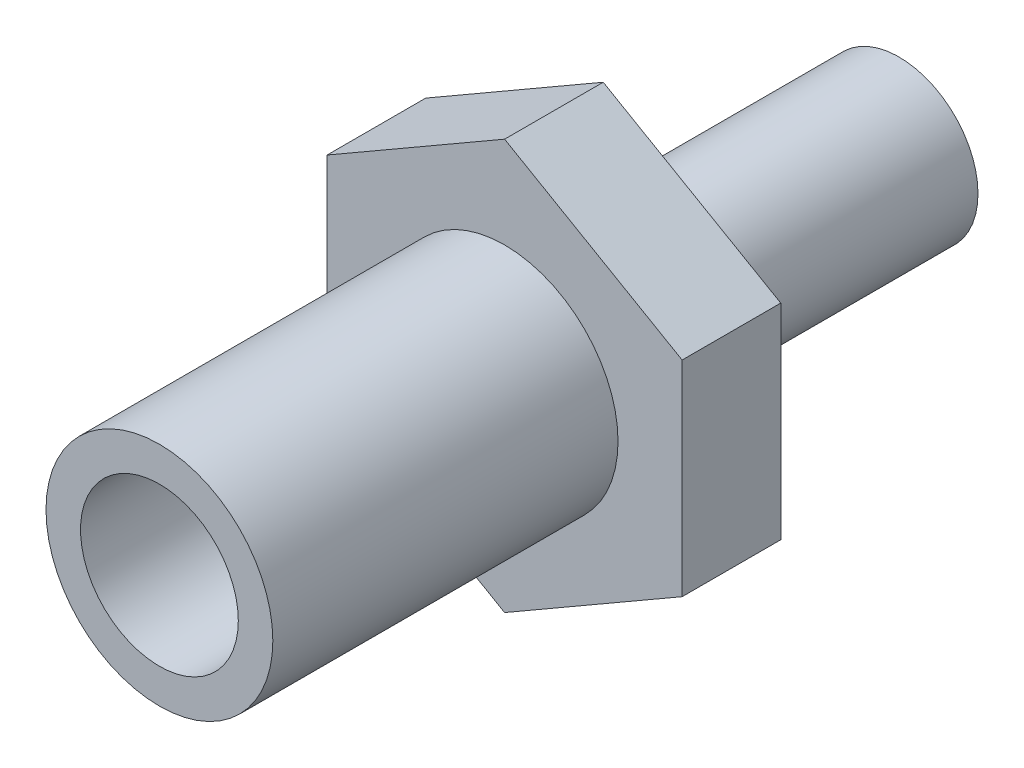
ISO-10303-21;
HEADER;
FILE_DESCRIPTION(('STEP AP214'),'2;1');
FILE_NAME('part.step','',(''),(''),'','','');
FILE_SCHEMA(('AUTOMOTIVE_DESIGN { 1 0 10303 214 1 1 1 1 }'));
ENDSEC;
DATA;
#1=APPLICATION_CONTEXT('core data for automotive mechanical design processes');
#2=APPLICATION_PROTOCOL_DEFINITION('international standard','automotive_design',2000,#1);
#3=PRODUCT_CONTEXT('',#1,'mechanical');
#4=PRODUCT('Part','Part','',(#3));
#5=PRODUCT_RELATED_PRODUCT_CATEGORY('part','',(#4));
#6=PRODUCT_DEFINITION_FORMATION('','',#4);
#7=PRODUCT_DEFINITION_CONTEXT('part definition',#1,'design');
#8=PRODUCT_DEFINITION('design','',#6,#7);
#9=PRODUCT_DEFINITION_SHAPE('','',#8);
#10=(LENGTH_UNIT() NAMED_UNIT(*) SI_UNIT(.MILLI.,.METRE.));
#11=(NAMED_UNIT(*) PLANE_ANGLE_UNIT() SI_UNIT($,.RADIAN.));
#12=(NAMED_UNIT(*) SI_UNIT($,.STERADIAN.) SOLID_ANGLE_UNIT());
#13=UNCERTAINTY_MEASURE_WITH_UNIT(LENGTH_MEASURE(1.E-05),#10,'distance_accuracy_value','');
#14=(GEOMETRIC_REPRESENTATION_CONTEXT(3) GLOBAL_UNCERTAINTY_ASSIGNED_CONTEXT((#13)) GLOBAL_UNIT_ASSIGNED_CONTEXT((#10,
#11,#12)) REPRESENTATION_CONTEXT('',''));
#15=CARTESIAN_POINT('',(0.,0.,0.));
#16=DIRECTION('',(0.,0.,1.));
#17=DIRECTION('',(1.,0.,0.));
#18=AXIS2_PLACEMENT_3D('',#15,#16,#17);
#19=CARTESIAN_POINT('',(22.,0.,10.));
#20=DIRECTION('',(0.,0.,-1.));
#21=DIRECTION('',(-1.,0.,0.));
#22=AXIS2_PLACEMENT_3D('',#19,#20,#21);
#23=PLANE('',#22);
#24=DIRECTION('',(-0.866025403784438,0.5,0.));
#25=VECTOR('',#24,1.);
#26=CARTESIAN_POINT('',(0.,-20.7846096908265,10.));
#27=LINE('',#26,#25);
#28=CARTESIAN_POINT('',(0.,-20.7846096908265,10.));
#29=VERTEX_POINT('',#28);
#30=CARTESIAN_POINT('',(-18.,-10.3923048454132,10.));
#31=VERTEX_POINT('',#30);
#32=EDGE_CURVE('E95',#29,#31,#27,.T.);
#33=ORIENTED_EDGE('',*,*,#32,.F.);
#34=DIRECTION('',(0.866025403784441,0.5,0.));
#35=VECTOR('',#34,1.);
#36=CARTESIAN_POINT('',(0.,-20.7846096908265,10.));
#37=LINE('',#36,#35);
#38=CARTESIAN_POINT('',(18.,-10.3923048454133,10.));
#39=VERTEX_POINT('',#38);
#40=EDGE_CURVE('E37',#29,#39,#37,.T.);
#41=ORIENTED_EDGE('',*,*,#40,.T.);
#42=DIRECTION('',(0.,-1.,0.));
#43=VECTOR('',#42,1.);
#44=CARTESIAN_POINT('',(18.,10.3923048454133,10.));
#45=LINE('',#44,#43);
#46=CARTESIAN_POINT('',(18.,10.3923048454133,10.));
#47=VERTEX_POINT('',#46);
#48=EDGE_CURVE('E74',#47,#39,#45,.T.);
#49=ORIENTED_EDGE('',*,*,#48,.F.);
#50=DIRECTION('',(0.866025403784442,-0.5,0.));
#51=VECTOR('',#50,1.);
#52=CARTESIAN_POINT('',(0.,20.7846096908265,10.));
#53=LINE('',#52,#51);
#54=CARTESIAN_POINT('',(0.,20.7846096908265,10.));
#55=VERTEX_POINT('',#54);
#56=EDGE_CURVE('E104',#55,#47,#53,.T.);
#57=ORIENTED_EDGE('',*,*,#56,.F.);
#58=DIRECTION('',(-0.866025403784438,-0.5,0.));
#59=VECTOR('',#58,1.);
#60=CARTESIAN_POINT('',(0.,20.7846096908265,10.));
#61=LINE('',#60,#59);
#62=CARTESIAN_POINT('',(-18.,10.3923048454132,10.));
#63=VERTEX_POINT('',#62);
#64=EDGE_CURVE('E101',#55,#63,#61,.T.);
#65=ORIENTED_EDGE('',*,*,#64,.T.);
#66=DIRECTION('',(0.,-1.,0.));
#67=VECTOR('',#66,1.);
#68=CARTESIAN_POINT('',(-18.,10.3923048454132,10.));
#69=LINE('',#68,#67);
#70=EDGE_CURVE('E98',#63,#31,#69,.T.);
#71=ORIENTED_EDGE('',*,*,#70,.T.);
#72=EDGE_LOOP('',(#33,#41,#49,#57,#65,#71));
#73=FACE_BOUND('',#72,.T.);
#74=CARTESIAN_POINT('',(0.,0.,10.));
#75=DIRECTION('',(0.,0.,1.));
#76=DIRECTION('',(1.,0.,0.));
#77=AXIS2_PLACEMENT_3D('',#74,#75,#76);
#78=CIRCLE('',#77,11.5);
#79=CARTESIAN_POINT('',(11.5,0.,10.));
#80=VERTEX_POINT('',#79);
#81=EDGE_CURVE('E9',#80,#80,#78,.T.);
#82=ORIENTED_EDGE('',*,*,#81,.F.);
#83=EDGE_LOOP('',(#82));
#84=FACE_BOUND('',#83,.T.);
#85=ADVANCED_FACE('F14',(#73,#84),#23,.F.);
#86=CARTESIAN_POINT('',(0.,0.,50.));
#87=DIRECTION('',(0.,0.,1.));
#88=DIRECTION('',(1.,0.,0.));
#89=AXIS2_PLACEMENT_3D('',#86,#87,#88);
#90=CYLINDRICAL_SURFACE('',#89,11.5);
#91=CARTESIAN_POINT('',(0.,0.,45.));
#92=DIRECTION('',(0.,0.,1.));
#93=DIRECTION('',(1.,0.,0.));
#94=AXIS2_PLACEMENT_3D('',#91,#92,#93);
#95=CIRCLE('',#94,11.5);
#96=CARTESIAN_POINT('',(11.5,0.,45.));
#97=VERTEX_POINT('',#96);
#98=EDGE_CURVE('E22',#97,#97,#95,.T.);
#99=ORIENTED_EDGE('',*,*,#98,.F.);
#100=EDGE_LOOP('',(#99));
#101=FACE_BOUND('',#100,.T.);
#102=ORIENTED_EDGE('',*,*,#81,.T.);
#103=EDGE_LOOP('',(#102));
#104=FACE_BOUND('',#103,.T.);
#105=ADVANCED_FACE('F133',(#101,#104),#90,.T.);
#106=CARTESIAN_POINT('',(11.5,0.,45.));
#107=DIRECTION('',(0.,0.,-1.));
#108=DIRECTION('',(-1.,0.,0.));
#109=AXIS2_PLACEMENT_3D('',#106,#107,#108);
#110=PLANE('',#109);
#111=CARTESIAN_POINT('',(0.,0.,45.));
#112=DIRECTION('',(0.,0.,1.));
#113=DIRECTION('',(1.,0.,0.));
#114=AXIS2_PLACEMENT_3D('',#111,#112,#113);
#115=CIRCLE('',#114,8.);
#116=CARTESIAN_POINT('',(8.,0.,45.));
#117=VERTEX_POINT('',#116);
#118=EDGE_CURVE('E126',#117,#117,#115,.T.);
#119=ORIENTED_EDGE('',*,*,#118,.F.);
#120=EDGE_LOOP('',(#119));
#121=FACE_BOUND('',#120,.T.);
#122=ORIENTED_EDGE('',*,*,#98,.T.);
#123=EDGE_LOOP('',(#122));
#124=FACE_BOUND('',#123,.T.);
#125=ADVANCED_FACE('F131',(#121,#124),#110,.F.);
#126=CARTESIAN_POINT('',(0.,0.,50.));
#127=DIRECTION('',(0.,0.,1.));
#128=DIRECTION('',(1.,0.,0.));
#129=AXIS2_PLACEMENT_3D('',#126,#127,#128);
#130=CYLINDRICAL_SURFACE('',#129,8.);
#131=CARTESIAN_POINT('',(0.,0.,11.));
#132=DIRECTION('',(0.,0.,1.));
#133=DIRECTION('',(1.,0.,0.));
#134=AXIS2_PLACEMENT_3D('',#131,#132,#133);
#135=CIRCLE('',#134,8.);
#136=CARTESIAN_POINT('',(8.,0.,11.));
#137=VERTEX_POINT('',#136);
#138=EDGE_CURVE('E123',#137,#137,#135,.T.);
#139=ORIENTED_EDGE('',*,*,#138,.F.);
#140=EDGE_LOOP('',(#139));
#141=FACE_BOUND('',#140,.T.);
#142=ORIENTED_EDGE('',*,*,#118,.T.);
#143=EDGE_LOOP('',(#142));
#144=FACE_BOUND('',#143,.T.);
#145=ADVANCED_FACE('F149',(#141,#144),#130,.F.);
#146=CARTESIAN_POINT('',(8.,0.,11.));
#147=DIRECTION('',(0.,0.,-1.));
#148=DIRECTION('',(-1.,0.,0.));
#149=AXIS2_PLACEMENT_3D('',#146,#147,#148);
#150=PLANE('',#149);
#151=ORIENTED_EDGE('',*,*,#138,.T.);
#152=EDGE_LOOP('',(#151));
#153=FACE_BOUND('',#152,.T.);
#154=ADVANCED_FACE('F153',(#153),#150,.F.);
#155=CARTESIAN_POINT('',(0.,-20.7846096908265,10.));
#156=DIRECTION('',(-0.5,0.866025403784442,0.));
#157=DIRECTION('',(-0.866025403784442,-0.5,0.));
#158=AXIS2_PLACEMENT_3D('',#155,#156,#157);
#159=PLANE('',#158);
#160=DIRECTION('',(0.,0.,-1.));
#161=VECTOR('',#160,1.);
#162=CARTESIAN_POINT('',(18.,-10.3923048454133,10.));
#163=LINE('',#162,#161);
#164=CARTESIAN_POINT('',(18.,-10.3923048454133,0.));
#165=VERTEX_POINT('',#164);
#166=EDGE_CURVE('E67',#39,#165,#163,.T.);
#167=ORIENTED_EDGE('',*,*,#166,.F.);
#168=ORIENTED_EDGE('',*,*,#40,.F.);
#169=DIRECTION('',(0.,0.,-1.));
#170=VECTOR('',#169,1.);
#171=CARTESIAN_POINT('',(0.,-20.7846096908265,10.));
#172=LINE('',#171,#170);
#173=CARTESIAN_POINT('',(0.,-20.7846096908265,0.));
#174=VERTEX_POINT('',#173);
#175=EDGE_CURVE('E81',#29,#174,#172,.T.);
#176=ORIENTED_EDGE('',*,*,#175,.T.);
#177=DIRECTION('',(0.866025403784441,0.5,0.));
#178=VECTOR('',#177,1.);
#179=CARTESIAN_POINT('',(0.,-20.7846096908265,0.));
#180=LINE('',#179,#178);
#181=EDGE_CURVE('E79',#174,#165,#180,.T.);
#182=ORIENTED_EDGE('',*,*,#181,.T.);
#183=EDGE_LOOP('',(#167,#168,#176,#182));
#184=FACE_BOUND('',#183,.T.);
#185=ADVANCED_FACE('F80',(#184),#159,.F.);
#186=CARTESIAN_POINT('',(18.,10.3923048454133,10.));
#187=DIRECTION('',(1.,0.,0.));
#188=DIRECTION('',(0.,1.,0.));
#189=AXIS2_PLACEMENT_3D('',#186,#187,#188);
#190=PLANE('',#189);
#191=DIRECTION('',(0.,0.,-1.));
#192=VECTOR('',#191,1.);
#193=CARTESIAN_POINT('',(18.,10.3923048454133,10.));
#194=LINE('',#193,#192);
#195=CARTESIAN_POINT('',(18.,10.3923048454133,0.));
#196=VERTEX_POINT('',#195);
#197=EDGE_CURVE('E76',#47,#196,#194,.T.);
#198=ORIENTED_EDGE('',*,*,#197,.F.);
#199=ORIENTED_EDGE('',*,*,#48,.T.);
#200=ORIENTED_EDGE('',*,*,#166,.T.);
#201=DIRECTION('',(0.,-1.,0.));
#202=VECTOR('',#201,1.);
#203=CARTESIAN_POINT('',(18.,10.3923048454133,0.));
#204=LINE('',#203,#202);
#205=EDGE_CURVE('E71',#196,#165,#204,.T.);
#206=ORIENTED_EDGE('',*,*,#205,.F.);
#207=EDGE_LOOP('',(#198,#199,#200,#206));
#208=FACE_BOUND('',#207,.T.);
#209=ADVANCED_FACE('F69',(#208),#190,.T.);
#210=CARTESIAN_POINT('',(0.,20.7846096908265,10.));
#211=DIRECTION('',(0.5,0.866025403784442,0.));
#212=DIRECTION('',(-0.866025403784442,0.5,0.));
#213=AXIS2_PLACEMENT_3D('',#210,#211,#212);
#214=PLANE('',#213);
#215=DIRECTION('',(0.,0.,-1.));
#216=VECTOR('',#215,1.);
#217=CARTESIAN_POINT('',(0.,20.7846096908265,10.));
#218=LINE('',#217,#216);
#219=CARTESIAN_POINT('',(0.,20.7846096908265,0.));
#220=VERTEX_POINT('',#219);
#221=EDGE_CURVE('E115',#55,#220,#218,.T.);
#222=ORIENTED_EDGE('',*,*,#221,.F.);
#223=ORIENTED_EDGE('',*,*,#56,.T.);
#224=ORIENTED_EDGE('',*,*,#197,.T.);
#225=DIRECTION('',(0.866025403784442,-0.5,0.));
#226=VECTOR('',#225,1.);
#227=CARTESIAN_POINT('',(0.,20.7846096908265,0.));
#228=LINE('',#227,#226);
#229=EDGE_CURVE('E89',#220,#196,#228,.T.);
#230=ORIENTED_EDGE('',*,*,#229,.F.);
#231=EDGE_LOOP('',(#222,#223,#224,#230));
#232=FACE_BOUND('',#231,.T.);
#233=ADVANCED_FACE('F169',(#232),#214,.T.);
#234=CARTESIAN_POINT('',(0.,20.7846096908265,10.));
#235=DIRECTION('',(0.5,-0.866025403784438,0.));
#236=DIRECTION('',(0.866025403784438,0.5,0.));
#237=AXIS2_PLACEMENT_3D('',#234,#235,#236);
#238=PLANE('',#237);
#239=DIRECTION('',(0.,0.,-1.));
#240=VECTOR('',#239,1.);
#241=CARTESIAN_POINT('',(-18.,10.3923048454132,10.));
#242=LINE('',#241,#240);
#243=CARTESIAN_POINT('',(-18.,10.3923048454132,0.));
#244=VERTEX_POINT('',#243);
#245=EDGE_CURVE('E113',#63,#244,#242,.T.);
#246=ORIENTED_EDGE('',*,*,#245,.F.);
#247=ORIENTED_EDGE('',*,*,#64,.F.);
#248=ORIENTED_EDGE('',*,*,#221,.T.);
#249=DIRECTION('',(-0.866025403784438,-0.5,0.));
#250=VECTOR('',#249,1.);
#251=CARTESIAN_POINT('',(0.,20.7846096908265,0.));
#252=LINE('',#251,#250);
#253=EDGE_CURVE('E91',#220,#244,#252,.T.);
#254=ORIENTED_EDGE('',*,*,#253,.T.);
#255=EDGE_LOOP('',(#246,#247,#248,#254));
#256=FACE_BOUND('',#255,.T.);
#257=ADVANCED_FACE('F172',(#256),#238,.F.);
#258=CARTESIAN_POINT('',(-18.,10.3923048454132,10.));
#259=DIRECTION('',(1.,0.,0.));
#260=DIRECTION('',(0.,1.,0.));
#261=AXIS2_PLACEMENT_3D('',#258,#259,#260);
#262=PLANE('',#261);
#263=DIRECTION('',(0.,0.,-1.));
#264=VECTOR('',#263,1.);
#265=CARTESIAN_POINT('',(-18.,-10.3923048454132,10.));
#266=LINE('',#265,#264);
#267=CARTESIAN_POINT('',(-18.,-10.3923048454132,0.));
#268=VERTEX_POINT('',#267);
#269=EDGE_CURVE('E111',#31,#268,#266,.T.);
#270=ORIENTED_EDGE('',*,*,#269,.F.);
#271=ORIENTED_EDGE('',*,*,#70,.F.);
#272=ORIENTED_EDGE('',*,*,#245,.T.);
#273=DIRECTION('',(0.,-1.,0.));
#274=VECTOR('',#273,1.);
#275=CARTESIAN_POINT('',(-18.,10.3923048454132,0.));
#276=LINE('',#275,#274);
#277=EDGE_CURVE('E29',#244,#268,#276,.T.);
#278=ORIENTED_EDGE('',*,*,#277,.T.);
#279=EDGE_LOOP('',(#270,#271,#272,#278));
#280=FACE_BOUND('',#279,.T.);
#281=ADVANCED_FACE('F176',(#280),#262,.F.);
#282=CARTESIAN_POINT('',(0.,-20.7846096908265,10.));
#283=DIRECTION('',(-0.5,-0.866025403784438,0.));
#284=DIRECTION('',(0.866025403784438,-0.5,0.));
#285=AXIS2_PLACEMENT_3D('',#282,#283,#284);
#286=PLANE('',#285);
#287=ORIENTED_EDGE('',*,*,#32,.T.);
#288=ORIENTED_EDGE('',*,*,#269,.T.);
#289=DIRECTION('',(-0.866025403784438,0.5,0.));
#290=VECTOR('',#289,1.);
#291=CARTESIAN_POINT('',(0.,-20.7846096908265,0.));
#292=LINE('',#291,#290);
#293=EDGE_CURVE('E109',#174,#268,#292,.T.);
#294=ORIENTED_EDGE('',*,*,#293,.F.);
#295=ORIENTED_EDGE('',*,*,#175,.F.);
#296=EDGE_LOOP('',(#287,#288,#294,#295));
#297=FACE_BOUND('',#296,.T.);
#298=ADVANCED_FACE('F162',(#297),#286,.T.);
#299=CARTESIAN_POINT('',(0.,0.,-30.));
#300=DIRECTION('',(0.,0.,1.));
#301=DIRECTION('',(1.,0.,0.));
#302=AXIS2_PLACEMENT_3D('',#299,#300,#301);
#303=PLANE('',#302);
#304=CARTESIAN_POINT('',(0.,0.,-30.));
#305=DIRECTION('',(0.,0.,1.));
#306=DIRECTION('',(1.,0.,0.));
#307=AXIS2_PLACEMENT_3D('',#304,#305,#306);
#308=CIRCLE('',#307,8.);
#309=CARTESIAN_POINT('',(8.,0.,-30.));
#310=VERTEX_POINT('',#309);
#311=EDGE_CURVE('E120',#310,#310,#308,.T.);
#312=ORIENTED_EDGE('',*,*,#311,.F.);
#313=EDGE_LOOP('',(#312));
#314=FACE_BOUND('',#313,.T.);
#315=ADVANCED_FACE('F158',(#314),#303,.F.);
#316=CARTESIAN_POINT('',(0.,0.,50.));
#317=DIRECTION('',(0.,0.,1.));
#318=DIRECTION('',(1.,0.,0.));
#319=AXIS2_PLACEMENT_3D('',#316,#317,#318);
#320=CYLINDRICAL_SURFACE('',#319,8.);
#321=CARTESIAN_POINT('',(0.,0.,0.));
#322=DIRECTION('',(0.,0.,1.));
#323=DIRECTION('',(1.,0.,0.));
#324=AXIS2_PLACEMENT_3D('',#321,#322,#323);
#325=CIRCLE('',#324,8.);
#326=CARTESIAN_POINT('',(8.,0.,0.));
#327=VERTEX_POINT('',#326);
#328=EDGE_CURVE('E75',#327,#327,#325,.T.);
#329=ORIENTED_EDGE('',*,*,#328,.F.);
#330=EDGE_LOOP('',(#329));
#331=FACE_BOUND('',#330,.T.);
#332=ORIENTED_EDGE('',*,*,#311,.T.);
#333=EDGE_LOOP('',(#332));
#334=FACE_BOUND('',#333,.T.);
#335=ADVANCED_FACE('F161',(#331,#334),#320,.T.);
#336=CARTESIAN_POINT('',(8.,0.,0.));
#337=DIRECTION('',(0.,0.,1.));
#338=DIRECTION('',(1.,0.,0.));
#339=AXIS2_PLACEMENT_3D('',#336,#337,#338);
#340=PLANE('',#339);
#341=ORIENTED_EDGE('',*,*,#205,.T.);
#342=ORIENTED_EDGE('',*,*,#181,.F.);
#343=ORIENTED_EDGE('',*,*,#293,.T.);
#344=ORIENTED_EDGE('',*,*,#277,.F.);
#345=ORIENTED_EDGE('',*,*,#253,.F.);
#346=ORIENTED_EDGE('',*,*,#229,.T.);
#347=EDGE_LOOP('',(#341,#342,#343,#344,#345,#346));
#348=FACE_BOUND('',#347,.T.);
#349=ORIENTED_EDGE('',*,*,#328,.T.);
#350=EDGE_LOOP('',(#349));
#351=FACE_BOUND('',#350,.T.);
#352=ADVANCED_FACE('F16',(#348,#351),#340,.F.);
#353=CLOSED_SHELL('',(#85,#105,#125,#145,#154,#185,#209,#233,#257,#281,#298,#315,#335,#352));
#354=MANIFOLD_SOLID_BREP('B1',#353);
#355=ADVANCED_BREP_SHAPE_REPRESENTATION('',(#18,#354),#14);
#356=SHAPE_DEFINITION_REPRESENTATION(#9,#355);
ENDSEC;
END-ISO-10303-21;
